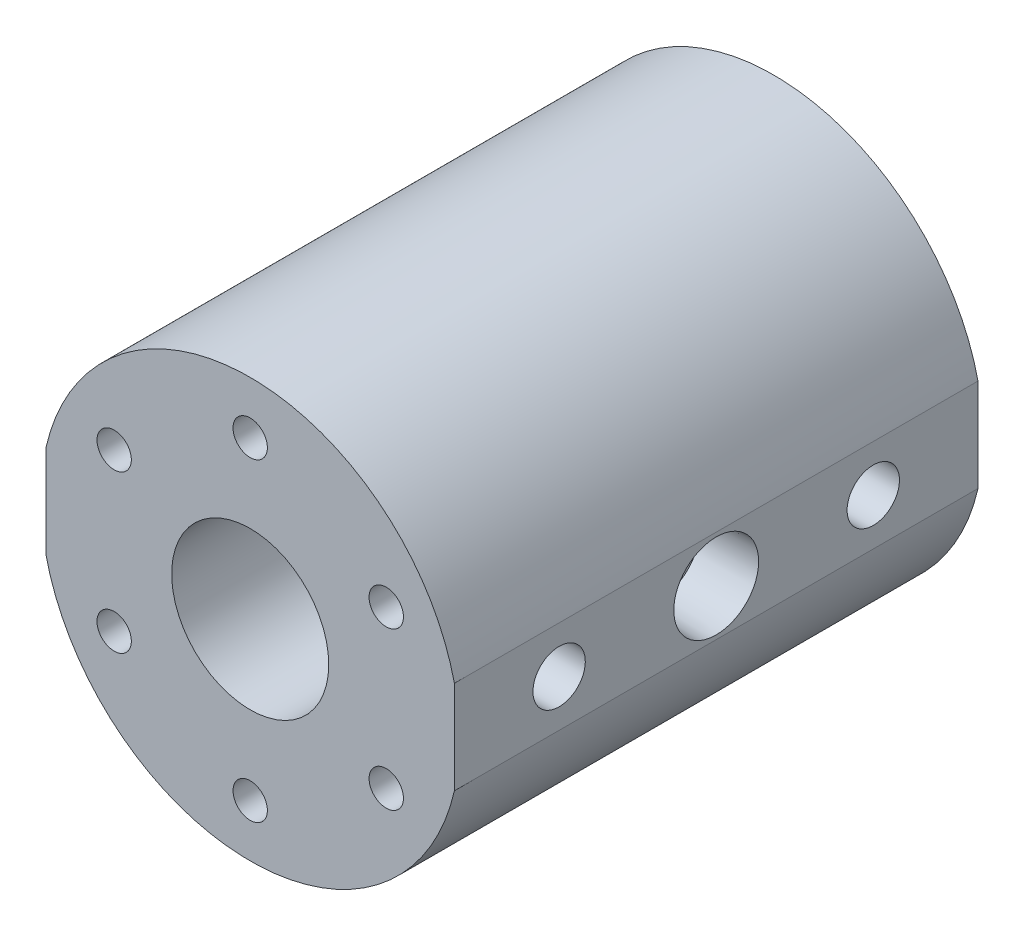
from build123d import *

# Parameters (mm, degrees)
SKETCH1_R                      = 9.525
EXTRUDE1_DEPTH                 = 31.75
F_8_32_TAPPED_HOLE1_AT_2_COUNT = 2
F_8_32_TAPPED_HOLE1_AT_2_PITCH = 19.05
F_8_32_TAPPED_HOLE1_AT_3_COUNT = 2
F_8_32_TAPPED_HOLE1_AT_3_PITCH = 32.995567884
F_8_32_TAPPED_HOLE1_AT_4_COUNT = 2
F_8_32_TAPPED_HOLE1_AT_4_PITCH = 38.1
F_8_32_TAPPED_HOLE1_AT_5_COUNT = 2
F_8_32_TAPPED_HOLE1_AT_5_PITCH = 19.05
F_8_32_TAPPED_HOLE1_AT_6_COUNT = 2
F_8_32_TAPPED_HOLE1_AT_6_PITCH = 32.995567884
CYLINDER_HOLES_AT_2_COUNT      = 2
CYLINDER_HOLES_AT_2_PITCH      = 25.4
CUT_EXTRUDE1_REACH             = 66.082
CUT_EXTRUDE1_END_RADIUS        = 9.525
SKETCH12_R                     = 3.175
CUT_EXTRUDE2_REACH             = 66.082
CUT_EXTRUDE2_END_RADIUS        = 9.525
SKETCH13_R                     = 3.175


with BuildPart() as part:
    # Sketch1 → Extrude1 (new, symmetric)
    with BuildSketch(Plane.XY):
        with BuildLine():
            Line((-24.765, 5.644003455), (-24.765, -5.644003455))
            ThreePointArc((-24.765, -5.644003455), (0, -25.4), (24.765, -5.644003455))
            Line((24.765, -5.644003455), (24.765, 5.644003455))
            ThreePointArc((24.765, 5.644003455), (0, 25.4), (-24.765, 5.644003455))
        make_face()
        Circle(SKETCH1_R, mode=Mode.SUBTRACT)
    extrude(amount=EXTRUDE1_DEPTH, both=True)

    # Sketch2 → 8-32 Tapped Hole1 (revolve, cut)
    with BuildSketch(Plane(origin=(16.497783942, 9.525, 31.75), x_dir=(0, -1, 0), z_dir=(1, 0, 0))):
        Polygon((0, 0), (0, 21.205406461), (1.7272, 20.1676), (1.7272, 17.78), (2.0828, 17.78), (2.0828, 0), align=None)
    f_8_32_tapped_hole1 = revolve(axis=Axis((16.497783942, 9.525, 38.1), (0, 0, -1)), mode=Mode.SUBTRACT)

    # 8-32 Tapped Hole1 at 2: 8-32 Tapped Hole1 ×2
    with Locations(*[Vector(-0.8660254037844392, 0.49999999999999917, 0) * (i * F_8_32_TAPPED_HOLE1_AT_2_PITCH) for i in range(1, F_8_32_TAPPED_HOLE1_AT_2_COUNT)]):
        add(f_8_32_tapped_hole1, mode=Mode.SUBTRACT)

    # 8-32 Tapped Hole1 at 3: 8-32 Tapped Hole1 ×2
    with Locations(*[(-i * F_8_32_TAPPED_HOLE1_AT_3_PITCH, 0, 0) for i in range(1, F_8_32_TAPPED_HOLE1_AT_3_COUNT)]):
        add(f_8_32_tapped_hole1, mode=Mode.SUBTRACT)

    # 8-32 Tapped Hole1 at 4: 8-32 Tapped Hole1 ×2
    with Locations(*[Vector(-0.8660254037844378, -0.5000000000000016, 0) * (i * F_8_32_TAPPED_HOLE1_AT_4_PITCH) for i in range(1, F_8_32_TAPPED_HOLE1_AT_4_COUNT)]):
        add(f_8_32_tapped_hole1, mode=Mode.SUBTRACT)

    # 8-32 Tapped Hole1 at 5: 8-32 Tapped Hole1 ×2
    with Locations(*[(0, -i * F_8_32_TAPPED_HOLE1_AT_5_PITCH, 0) for i in range(1, F_8_32_TAPPED_HOLE1_AT_5_COUNT)]):
        add(f_8_32_tapped_hole1, mode=Mode.SUBTRACT)

    # 8-32 Tapped Hole1 at 6: 8-32 Tapped Hole1 ×2
    with Locations(*[Vector(-0.4999999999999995, -0.866025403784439, 0) * (i * F_8_32_TAPPED_HOLE1_AT_6_PITCH) for i in range(1, F_8_32_TAPPED_HOLE1_AT_6_COUNT)]):
        add(f_8_32_tapped_hole1, mode=Mode.SUBTRACT)

    # Mirror1: 8-32 Tapped Hole1 across plane
    add(f_8_32_tapped_hole1.mirror(Plane.XY), mode=Mode.SUBTRACT)

    # Mirror1 copy 1 sketch → Mirror1 copy 1 (revolve, cut)
    with BuildSketch(Plane(origin=(0, 19.05, -31.75), x_dir=(0, -1, 0), z_dir=(1, 0, 0))):
        Polygon((0, 0), (0, -21.205406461), (1.7272, -20.1676), (1.7272, -17.78), (2.0828, -17.78), (2.0828, 0), align=None)
    revolve(axis=Axis((0, 19.05, -38.1), (0, 0, -1)), mode=Mode.SUBTRACT)

    # Mirror1 copy 2 sketch → Mirror1 copy 2 (revolve, cut)
    with BuildSketch(Plane(origin=(-16.497783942, 9.525, -31.75), x_dir=(0, -1, 0), z_dir=(1, 0, 0))):
        Polygon((0, 0), (0, -21.205406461), (1.7272, -20.1676), (1.7272, -17.78), (2.0828, -17.78), (2.0828, 0), align=None)
    revolve(axis=Axis((-16.497783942, 9.525, -38.1), (0, 0, -1)), mode=Mode.SUBTRACT)

    # Mirror1 copy 3 sketch → Mirror1 copy 3 (revolve, cut)
    with BuildSketch(Plane(origin=(-16.497783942, -9.525, -31.75), x_dir=(0, -1, 0), z_dir=(1, 0, 0))):
        Polygon((0, 0), (0, -21.205406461), (1.7272, -20.1676), (1.7272, -17.78), (2.0828, -17.78), (2.0828, 0), align=None)
    revolve(axis=Axis((-16.497783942, -9.525, -38.1), (0, 0, -1)), mode=Mode.SUBTRACT)

    # Mirror1 copy 4 sketch → Mirror1 copy 4 (revolve, cut)
    with BuildSketch(Plane(origin=(16.497783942, -9.525, -31.75), x_dir=(0, -1, 0), z_dir=(1, 0, 0))):
        Polygon((0, 0), (0, -21.205406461), (1.7272, -20.1676), (1.7272, -17.78), (2.0828, -17.78), (2.0828, 0), align=None)
    revolve(axis=Axis((16.497783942, -9.525, -38.1), (0, 0, -1)), mode=Mode.SUBTRACT)

    # Mirror1 copy 5 sketch → Mirror1 copy 5 (revolve, cut)
    with BuildSketch(Plane(origin=(0, -19.05, -31.75), x_dir=(0, -1, 0), z_dir=(1, 0, 0))):
        Polygon((0, 0), (0, -21.205406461), (1.7272, -20.1676), (1.7272, -17.78), (2.0828, -17.78), (2.0828, 0), align=None)
    revolve(axis=Axis((0, -19.05, -38.1), (0, 0, -1)), mode=Mode.SUBTRACT)

    # Sketch4 → Cylinder Holes (revolve, cut)
    with BuildSketch(Plane(origin=(-24.765, 0, 12.7), x_dir=(0, 0, 1), z_dir=(0, 1, 0))):
        Polygon((0, 0), (0, 14.156508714), (4.2164, 11.62304), (4.2164, 6.92404), (4.93618497, 6.92404), (5.1435, 0), align=None)
    cylinder_holes = revolve(axis=Axis((-31.115, 0, 12.7), (1, 0, 0)), mode=Mode.SUBTRACT)

    # Cylinder Holes at 2: Cylinder Holes ×2
    with Locations(*[(0, 0, -i * CYLINDER_HOLES_AT_2_PITCH) for i in range(1, CYLINDER_HOLES_AT_2_COUNT)]):
        add(cylinder_holes, mode=Mode.SUBTRACT)

    # Sketch7 → Steam Hole (revolve, cut)
    with BuildSketch(Plane(origin=(24.765, 0, 0), x_dir=(0, 0, -1), z_dir=(0, 1, 0))):
        Polygon((0, 0), (0, 10.788468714), (4.2164, 8.255), (4.2164, 6.92404), (4.93618497, 6.92404), (5.1435, 0), align=None)
    revolve(axis=Axis((31.115, 0, 0), (-1, 0, 0)), mode=Mode.SUBTRACT)

    # Cut-Extrude1: up to this cylinder (the profile starts outside it)
    cut_extrude1_end = Plane(origin=(0, 0, 0), z_dir=(0, 0, -1)) * Cylinder(CUT_EXTRUDE1_END_RADIUS, 190.314, mode=Mode.PRIVATE)
    # Sketch12 → Cut-Extrude1 (cut, up to the surface)
    with BuildSketch(Plane(origin=(24.765, 0, 0), x_dir=(0, 0, -1), z_dir=(1, 0, 0)), mode=Mode.PRIVATE) as cut_extrude1_sk1:
        with Locations(Location((-19.05, 0, 0), (0, 0, 90))):
            Circle(SKETCH12_R)
    cut_extrude1_tool1 = extrude(cut_extrude1_sk1.sketch, amount=-CUT_EXTRUDE1_REACH, mode=Mode.PRIVATE) - cut_extrude1_end
    add(cut_extrude1_tool1.solids().sort_by_distance((24.765, 0, 19.05))[0], mode=Mode.SUBTRACT)
    # Sketch12 → Cut-Extrude1 (cut, up to the surface)
    with BuildSketch(Plane(origin=(24.765, 0, 0), x_dir=(0, 0, -1), z_dir=(1, 0, 0)), mode=Mode.PRIVATE) as cut_extrude1_sk2:
        with Locations(Location((19.05, 0, 0), (0, 0, 90))):
            Circle(SKETCH12_R)
    cut_extrude1_tool2 = extrude(cut_extrude1_sk2.sketch, amount=-CUT_EXTRUDE1_REACH, mode=Mode.PRIVATE) - cut_extrude1_end
    add(cut_extrude1_tool2.solids().sort_by_distance((24.765, 0, -19.05))[0], mode=Mode.SUBTRACT)
    # Sketch12 → Cut-Extrude1 (cut, up to the surface)
    with BuildSketch(Plane(origin=(24.765, 0, 0), x_dir=(0, 0, -1), z_dir=(1, 0, 0)), mode=Mode.PRIVATE) as cut_extrude1_sk3:
        Circle(SKETCH12_R)
    cut_extrude1_tool3 = extrude(cut_extrude1_sk3.sketch, amount=-CUT_EXTRUDE1_REACH, mode=Mode.PRIVATE) - cut_extrude1_end
    add(cut_extrude1_tool3.solids().sort_by_distance((24.765, 0, 0))[0], mode=Mode.SUBTRACT)

    # Cut-Extrude2: up to this cylinder (the profile starts outside it)
    cut_extrude2_end = Plane(origin=(0, 0, 0), z_dir=(0, 0, -1)) * Cylinder(CUT_EXTRUDE2_END_RADIUS, 177.614, mode=Mode.PRIVATE)
    # Sketch13 → Cut-Extrude2 (cut, up to the surface)
    with BuildSketch(Plane.ZY.offset(24.765), mode=Mode.PRIVATE) as cut_extrude2_sk1:
        with Locations(Location((12.7, 0, 0), (0, 0, 270))):
            Circle(SKETCH13_R)
    cut_extrude2_tool1 = extrude(cut_extrude2_sk1.sketch, amount=-CUT_EXTRUDE2_REACH, mode=Mode.PRIVATE) - cut_extrude2_end
    add(cut_extrude2_tool1.solids().sort_by_distance((-24.765, 0, 12.7))[0], mode=Mode.SUBTRACT)
    # Sketch13 → Cut-Extrude2 (cut, up to the surface)
    with BuildSketch(Plane.ZY.offset(24.765), mode=Mode.PRIVATE) as cut_extrude2_sk2:
        with Locations(Location((-12.7, 0, 0), (0, 0, 270))):
            Circle(SKETCH13_R)
    cut_extrude2_tool2 = extrude(cut_extrude2_sk2.sketch, amount=-CUT_EXTRUDE2_REACH, mode=Mode.PRIVATE) - cut_extrude2_end
    add(cut_extrude2_tool2.solids().sort_by_distance((-24.765, 0, -12.7))[0], mode=Mode.SUBTRACT)


solid = part.part
